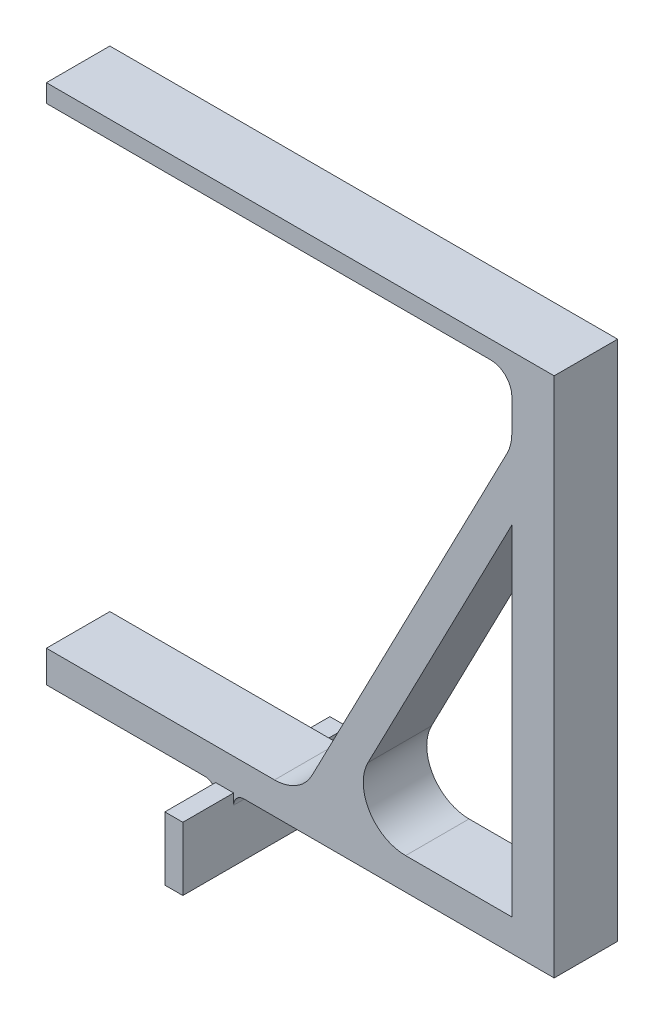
ISO-10303-21;
HEADER;
FILE_DESCRIPTION(('STEP AP214'),'2;1');
FILE_NAME('part.step','',(''),(''),'','','');
FILE_SCHEMA(('AUTOMOTIVE_DESIGN { 1 0 10303 214 1 1 1 1 }'));
ENDSEC;
DATA;
#1=APPLICATION_CONTEXT('core data for automotive mechanical design processes');
#2=APPLICATION_PROTOCOL_DEFINITION('international standard','automotive_design',2000,#1);
#3=PRODUCT_CONTEXT('',#1,'mechanical');
#4=PRODUCT('Part','Part','',(#3));
#5=PRODUCT_RELATED_PRODUCT_CATEGORY('part','',(#4));
#6=PRODUCT_DEFINITION_FORMATION('','',#4);
#7=PRODUCT_DEFINITION_CONTEXT('part definition',#1,'design');
#8=PRODUCT_DEFINITION('design','',#6,#7);
#9=PRODUCT_DEFINITION_SHAPE('','',#8);
#10=(LENGTH_UNIT() NAMED_UNIT(*) SI_UNIT(.MILLI.,.METRE.));
#11=(NAMED_UNIT(*) PLANE_ANGLE_UNIT() SI_UNIT($,.RADIAN.));
#12=(NAMED_UNIT(*) SI_UNIT($,.STERADIAN.) SOLID_ANGLE_UNIT());
#13=UNCERTAINTY_MEASURE_WITH_UNIT(LENGTH_MEASURE(1.E-05),#10,'distance_accuracy_value','');
#14=(GEOMETRIC_REPRESENTATION_CONTEXT(3) GLOBAL_UNCERTAINTY_ASSIGNED_CONTEXT((#13)) GLOBAL_UNIT_ASSIGNED_CONTEXT((#10,
#11,#12)) REPRESENTATION_CONTEXT('',''));
#15=CARTESIAN_POINT('',(0.,0.,0.));
#16=DIRECTION('',(0.,0.,1.));
#17=DIRECTION('',(1.,0.,0.));
#18=AXIS2_PLACEMENT_3D('',#15,#16,#17);
#19=CARTESIAN_POINT('',(0.,0.,3.));
#20=DIRECTION('',(0.,0.,1.));
#21=DIRECTION('',(1.,0.,0.));
#22=AXIS2_PLACEMENT_3D('',#19,#20,#21);
#23=PLANE('',#22);
#24=DIRECTION('',(-1.,0.,0.));
#25=VECTOR('',#24,1.);
#26=CARTESIAN_POINT('',(0.,3.,3.));
#27=LINE('',#26,#25);
#28=CARTESIAN_POINT('',(0.85,3.,3.));
#29=VERTEX_POINT('',#28);
#30=CARTESIAN_POINT('',(0.,3.,3.));
#31=VERTEX_POINT('',#30);
#32=EDGE_CURVE('E278',#29,#31,#27,.T.);
#33=ORIENTED_EDGE('',*,*,#32,.F.);
#34=DIRECTION('',(0.,1.,0.));
#35=VECTOR('',#34,1.);
#36=CARTESIAN_POINT('',(0.85,3.,3.));
#37=LINE('',#36,#35);
#38=CARTESIAN_POINT('',(0.85,2.5,3.));
#39=VERTEX_POINT('',#38);
#40=EDGE_CURVE('E403',#39,#29,#37,.T.);
#41=ORIENTED_EDGE('',*,*,#40,.F.);
#42=CARTESIAN_POINT('',(1.35,2.5,3.));
#43=DIRECTION('',(0.,0.,1.));
#44=DIRECTION('',(1.,0.,0.));
#45=AXIS2_PLACEMENT_3D('',#42,#43,#44);
#46=CIRCLE('',#45,0.5);
#47=CARTESIAN_POINT('',(1.35,3.,3.));
#48=VERTEX_POINT('',#47);
#49=EDGE_CURVE('E11',#39,#48,#46,.F.);
#50=ORIENTED_EDGE('',*,*,#49,.T.);
#51=DIRECTION('',(1.,0.,0.));
#52=VECTOR('',#51,1.);
#53=CARTESIAN_POINT('',(0.85,3.,3.));
#54=LINE('',#53,#52);
#55=CARTESIAN_POINT('',(16.,3.,3.));
#56=VERTEX_POINT('',#55);
#57=EDGE_CURVE('E224',#48,#56,#54,.T.);
#58=ORIENTED_EDGE('',*,*,#57,.T.);
#59=DIRECTION('',(0.,1.,0.));
#60=VECTOR('',#59,1.);
#61=CARTESIAN_POINT('',(16.,3.,3.));
#62=LINE('',#61,#60);
#63=CARTESIAN_POINT('',(16.,27.65,3.));
#64=VERTEX_POINT('',#63);
#65=EDGE_CURVE('E304',#56,#64,#62,.T.);
#66=ORIENTED_EDGE('',*,*,#65,.T.);
#67=DIRECTION('',(-1.,0.,0.));
#68=VECTOR('',#67,1.);
#69=CARTESIAN_POINT('',(14.,27.65,3.));
#70=LINE('',#69,#68);
#71=CARTESIAN_POINT('',(-8.,27.65,3.));
#72=VERTEX_POINT('',#71);
#73=EDGE_CURVE('E306',#64,#72,#70,.T.);
#74=ORIENTED_EDGE('',*,*,#73,.T.);
#75=DIRECTION('',(0.,-1.,0.));
#76=VECTOR('',#75,1.);
#77=CARTESIAN_POINT('',(-8.,27.65,3.));
#78=LINE('',#77,#76);
#79=CARTESIAN_POINT('',(-8.,26.8,3.));
#80=VERTEX_POINT('',#79);
#81=EDGE_CURVE('E308',#72,#80,#78,.T.);
#82=ORIENTED_EDGE('',*,*,#81,.T.);
#83=DIRECTION('',(1.,0.,0.));
#84=VECTOR('',#83,1.);
#85=CARTESIAN_POINT('',(14.,26.8,3.));
#86=LINE('',#85,#84);
#87=CARTESIAN_POINT('',(13.,26.8,3.));
#88=VERTEX_POINT('',#87);
#89=EDGE_CURVE('E310',#80,#88,#86,.T.);
#90=ORIENTED_EDGE('',*,*,#89,.T.);
#91=CARTESIAN_POINT('',(13.,25.8,3.));
#92=DIRECTION('',(0.,0.,1.));
#93=DIRECTION('',(1.,0.,0.));
#94=AXIS2_PLACEMENT_3D('',#91,#92,#93);
#95=CIRCLE('',#94,1.);
#96=CARTESIAN_POINT('',(14.,25.8,3.));
#97=VERTEX_POINT('',#96);
#98=EDGE_CURVE('E390',#88,#97,#95,.F.);
#99=ORIENTED_EDGE('',*,*,#98,.T.);
#100=DIRECTION('',(0.,-1.,0.));
#101=VECTOR('',#100,1.);
#102=CARTESIAN_POINT('',(14.,23.8,3.));
#103=LINE('',#102,#101);
#104=CARTESIAN_POINT('',(14.,24.2873670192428,3.));
#105=VERTEX_POINT('',#104);
#106=EDGE_CURVE('E313',#97,#105,#103,.T.);
#107=ORIENTED_EDGE('',*,*,#106,.T.);
#108=CARTESIAN_POINT('',(12.,24.2873670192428,3.));
#109=DIRECTION('',(0.,0.,1.));
#110=DIRECTION('',(1.,0.,0.));
#111=AXIS2_PLACEMENT_3D('',#108,#109,#110);
#112=CIRCLE('',#111,2.);
#113=CARTESIAN_POINT('',(13.7757874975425,23.367269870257,3.));
#114=VERTEX_POINT('',#113);
#115=EDGE_CURVE('E377',#105,#114,#112,.F.);
#116=ORIENTED_EDGE('',*,*,#115,.T.);
#117=DIRECTION('',(-0.460048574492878,-0.887893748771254,0.));
#118=VECTOR('',#117,1.);
#119=CARTESIAN_POINT('',(14.,23.8,3.));
#120=LINE('',#119,#118);
#121=CARTESIAN_POINT('',(4.55953515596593,5.57990285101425,3.));
#122=VERTEX_POINT('',#121);
#123=EDGE_CURVE('E315',#114,#122,#120,.T.);
#124=ORIENTED_EDGE('',*,*,#123,.T.);
#125=CARTESIAN_POINT('',(2.78374765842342,6.5,3.));
#126=DIRECTION('',(0.,0.,1.));
#127=DIRECTION('',(1.,0.,0.));
#128=AXIS2_PLACEMENT_3D('',#125,#126,#127);
#129=CIRCLE('',#128,2.);
#130=CARTESIAN_POINT('',(2.78374765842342,4.5,3.));
#131=VERTEX_POINT('',#130);
#132=EDGE_CURVE('E381',#122,#131,#129,.F.);
#133=ORIENTED_EDGE('',*,*,#132,.T.);
#134=DIRECTION('',(-1.,0.,0.));
#135=VECTOR('',#134,1.);
#136=CARTESIAN_POINT('',(-4.,4.5,3.));
#137=LINE('',#136,#135);
#138=CARTESIAN_POINT('',(-8.,4.5,3.));
#139=VERTEX_POINT('',#138);
#140=EDGE_CURVE('E318',#131,#139,#137,.T.);
#141=ORIENTED_EDGE('',*,*,#140,.T.);
#142=DIRECTION('',(0.,1.,0.));
#143=VECTOR('',#142,1.);
#144=CARTESIAN_POINT('',(-8.,3.,3.));
#145=LINE('',#144,#143);
#146=CARTESIAN_POINT('',(-8.,3.,3.));
#147=VERTEX_POINT('',#146);
#148=EDGE_CURVE('E235',#147,#139,#145,.T.);
#149=ORIENTED_EDGE('',*,*,#148,.F.);
#150=DIRECTION('',(1.,0.,0.));
#151=VECTOR('',#150,1.);
#152=CARTESIAN_POINT('',(0.,3.,3.));
#153=LINE('',#152,#151);
#154=CARTESIAN_POINT('',(-0.5,3.,3.));
#155=VERTEX_POINT('',#154);
#156=EDGE_CURVE('E231',#147,#155,#153,.T.);
#157=ORIENTED_EDGE('',*,*,#156,.T.);
#158=CARTESIAN_POINT('',(-0.5,2.5,3.));
#159=DIRECTION('',(0.,0.,1.));
#160=DIRECTION('',(1.,0.,0.));
#161=AXIS2_PLACEMENT_3D('',#158,#159,#160);
#162=CIRCLE('',#161,0.5);
#163=CARTESIAN_POINT('',(0.,2.5,3.));
#164=VERTEX_POINT('',#163);
#165=EDGE_CURVE('E410',#155,#164,#162,.F.);
#166=ORIENTED_EDGE('',*,*,#165,.T.);
#167=DIRECTION('',(0.,-1.,0.));
#168=VECTOR('',#167,1.);
#169=CARTESIAN_POINT('',(0.,3.,3.));
#170=LINE('',#169,#168);
#171=EDGE_CURVE('E62',#31,#164,#170,.T.);
#172=ORIENTED_EDGE('',*,*,#171,.F.);
#173=EDGE_LOOP('',(#33,#41,#50,#58,#66,#74,#82,#90,#99,#107,#116,#124,#133,#141,#149,#157,#166,#172));
#174=FACE_BOUND('',#173,.T.);
#175=DIRECTION('',(0.,1.,0.));
#176=VECTOR('',#175,1.);
#177=CARTESIAN_POINT('',(14.,4.5,3.));
#178=LINE('',#177,#176);
#179=CARTESIAN_POINT('',(14.,4.5,3.));
#180=VERTEX_POINT('',#179);
#181=CARTESIAN_POINT('',(14.,20.5394747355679,3.));
#182=VERTEX_POINT('',#181);
#183=EDGE_CURVE('E284',#180,#182,#178,.T.);
#184=ORIENTED_EDGE('',*,*,#183,.F.);
#185=DIRECTION('',(1.,0.,0.));
#186=VECTOR('',#185,1.);
#187=CARTESIAN_POINT('',(5.68939132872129,4.5,3.));
#188=LINE('',#187,#186);
#189=CARTESIAN_POINT('',(8.9781825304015,4.5,3.));
#190=VERTEX_POINT('',#189);
#191=EDGE_CURVE('E282',#190,#180,#188,.T.);
#192=ORIENTED_EDGE('',*,*,#191,.F.);
#193=CARTESIAN_POINT('',(8.9781825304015,6.5,3.));
#194=DIRECTION('',(0.,0.,1.));
#195=DIRECTION('',(1.,0.,0.));
#196=AXIS2_PLACEMENT_3D('',#193,#194,#195);
#197=CIRCLE('',#196,2.);
#198=CARTESIAN_POINT('',(7.20239503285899,7.42009714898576,3.));
#199=VERTEX_POINT('',#198);
#200=EDGE_CURVE('E372',#190,#199,#197,.F.);
#201=ORIENTED_EDGE('',*,*,#200,.T.);
#202=DIRECTION('',(-0.460048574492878,-0.887893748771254,0.));
#203=VECTOR('',#202,1.);
#204=CARTESIAN_POINT('',(5.68939132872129,4.5,3.));
#205=LINE('',#204,#203);
#206=EDGE_CURVE('E288',#182,#199,#205,.T.);
#207=ORIENTED_EDGE('',*,*,#206,.F.);
#208=EDGE_LOOP('',(#184,#192,#201,#207));
#209=FACE_BOUND('',#208,.T.);
#210=ADVANCED_FACE('F39',(#174,#209),#23,.T.);
#211=CARTESIAN_POINT('',(0.,0.,0.));
#212=DIRECTION('',(0.,0.,1.));
#213=DIRECTION('',(1.,0.,0.));
#214=AXIS2_PLACEMENT_3D('',#211,#212,#213);
#215=PLANE('',#214);
#216=DIRECTION('',(1.,0.,0.));
#217=VECTOR('',#216,1.);
#218=CARTESIAN_POINT('',(0.85,3.,0.));
#219=LINE('',#218,#217);
#220=CARTESIAN_POINT('',(1.35,3.,0.));
#221=VERTEX_POINT('',#220);
#222=CARTESIAN_POINT('',(16.,3.,0.));
#223=VERTEX_POINT('',#222);
#224=EDGE_CURVE('E302',#221,#223,#219,.T.);
#225=ORIENTED_EDGE('',*,*,#224,.F.);
#226=CARTESIAN_POINT('',(1.35,2.5,0.));
#227=DIRECTION('',(0.,0.,1.));
#228=DIRECTION('',(1.,0.,0.));
#229=AXIS2_PLACEMENT_3D('',#226,#227,#228);
#230=CIRCLE('',#229,0.5);
#231=CARTESIAN_POINT('',(0.85,2.5,0.));
#232=VERTEX_POINT('',#231);
#233=EDGE_CURVE('E47',#221,#232,#230,.T.);
#234=ORIENTED_EDGE('',*,*,#233,.T.);
#235=DIRECTION('',(0.,-1.,0.));
#236=VECTOR('',#235,1.);
#237=CARTESIAN_POINT('',(0.85,0.,0.));
#238=LINE('',#237,#236);
#239=CARTESIAN_POINT('',(0.85,3.,0.));
#240=VERTEX_POINT('',#239);
#241=EDGE_CURVE('E54',#240,#232,#238,.T.);
#242=ORIENTED_EDGE('',*,*,#241,.F.);
#243=DIRECTION('',(-1.,0.,0.));
#244=VECTOR('',#243,1.);
#245=CARTESIAN_POINT('',(0.,3.,0.));
#246=LINE('',#245,#244);
#247=CARTESIAN_POINT('',(0.,3.,0.));
#248=VERTEX_POINT('',#247);
#249=EDGE_CURVE('E273',#240,#248,#246,.T.);
#250=ORIENTED_EDGE('',*,*,#249,.T.);
#251=DIRECTION('',(0.,1.,0.));
#252=VECTOR('',#251,1.);
#253=CARTESIAN_POINT('',(0.,0.,0.));
#254=LINE('',#253,#252);
#255=CARTESIAN_POINT('',(0.,2.5,0.));
#256=VERTEX_POINT('',#255);
#257=EDGE_CURVE('E396',#256,#248,#254,.T.);
#258=ORIENTED_EDGE('',*,*,#257,.F.);
#259=CARTESIAN_POINT('',(-0.5,2.5,0.));
#260=DIRECTION('',(0.,0.,1.));
#261=DIRECTION('',(1.,0.,0.));
#262=AXIS2_PLACEMENT_3D('',#259,#260,#261);
#263=CIRCLE('',#262,0.5);
#264=CARTESIAN_POINT('',(-0.5,3.,0.));
#265=VERTEX_POINT('',#264);
#266=EDGE_CURVE('E221',#256,#265,#263,.T.);
#267=ORIENTED_EDGE('',*,*,#266,.T.);
#268=DIRECTION('',(1.,0.,0.));
#269=VECTOR('',#268,1.);
#270=CARTESIAN_POINT('',(0.,3.,0.));
#271=LINE('',#270,#269);
#272=CARTESIAN_POINT('',(-8.,3.,0.));
#273=VERTEX_POINT('',#272);
#274=EDGE_CURVE('E212',#273,#265,#271,.T.);
#275=ORIENTED_EDGE('',*,*,#274,.F.);
#276=DIRECTION('',(0.,-1.,0.));
#277=VECTOR('',#276,1.);
#278=CARTESIAN_POINT('',(-8.,3.,0.));
#279=LINE('',#278,#277);
#280=CARTESIAN_POINT('',(-8.,4.5,0.));
#281=VERTEX_POINT('',#280);
#282=EDGE_CURVE('E219',#281,#273,#279,.T.);
#283=ORIENTED_EDGE('',*,*,#282,.F.);
#284=DIRECTION('',(-1.,0.,0.));
#285=VECTOR('',#284,1.);
#286=CARTESIAN_POINT('',(-4.,4.5,0.));
#287=LINE('',#286,#285);
#288=CARTESIAN_POINT('',(2.78374765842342,4.5,0.));
#289=VERTEX_POINT('',#288);
#290=EDGE_CURVE('E225',#289,#281,#287,.T.);
#291=ORIENTED_EDGE('',*,*,#290,.F.);
#292=CARTESIAN_POINT('',(2.78374765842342,6.5,0.));
#293=DIRECTION('',(0.,0.,1.));
#294=DIRECTION('',(1.,0.,0.));
#295=AXIS2_PLACEMENT_3D('',#292,#293,#294);
#296=CIRCLE('',#295,2.);
#297=CARTESIAN_POINT('',(4.55953515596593,5.57990285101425,0.));
#298=VERTEX_POINT('',#297);
#299=EDGE_CURVE('E379',#289,#298,#296,.T.);
#300=ORIENTED_EDGE('',*,*,#299,.T.);
#301=DIRECTION('',(-0.460048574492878,-0.887893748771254,0.));
#302=VECTOR('',#301,1.);
#303=CARTESIAN_POINT('',(14.,23.8,0.));
#304=LINE('',#303,#302);
#305=CARTESIAN_POINT('',(13.7757874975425,23.367269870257,0.));
#306=VERTEX_POINT('',#305);
#307=EDGE_CURVE('E335',#306,#298,#304,.T.);
#308=ORIENTED_EDGE('',*,*,#307,.F.);
#309=CARTESIAN_POINT('',(12.,24.2873670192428,0.));
#310=DIRECTION('',(0.,0.,1.));
#311=DIRECTION('',(1.,0.,0.));
#312=AXIS2_PLACEMENT_3D('',#309,#310,#311);
#313=CIRCLE('',#312,2.);
#314=CARTESIAN_POINT('',(14.,24.2873670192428,0.));
#315=VERTEX_POINT('',#314);
#316=EDGE_CURVE('E374',#306,#315,#313,.T.);
#317=ORIENTED_EDGE('',*,*,#316,.T.);
#318=DIRECTION('',(0.,-1.,0.));
#319=VECTOR('',#318,1.);
#320=CARTESIAN_POINT('',(14.,23.8,0.));
#321=LINE('',#320,#319);
#322=CARTESIAN_POINT('',(14.,25.8,0.));
#323=VERTEX_POINT('',#322);
#324=EDGE_CURVE('E333',#323,#315,#321,.T.);
#325=ORIENTED_EDGE('',*,*,#324,.F.);
#326=CARTESIAN_POINT('',(13.,25.8,0.));
#327=DIRECTION('',(0.,0.,1.));
#328=DIRECTION('',(1.,0.,0.));
#329=AXIS2_PLACEMENT_3D('',#326,#327,#328);
#330=CIRCLE('',#329,1.);
#331=CARTESIAN_POINT('',(13.,26.8,0.));
#332=VERTEX_POINT('',#331);
#333=EDGE_CURVE('E388',#323,#332,#330,.T.);
#334=ORIENTED_EDGE('',*,*,#333,.T.);
#335=DIRECTION('',(1.,0.,0.));
#336=VECTOR('',#335,1.);
#337=CARTESIAN_POINT('',(14.,26.8,0.));
#338=LINE('',#337,#336);
#339=CARTESIAN_POINT('',(-8.,26.8,0.));
#340=VERTEX_POINT('',#339);
#341=EDGE_CURVE('E330',#340,#332,#338,.T.);
#342=ORIENTED_EDGE('',*,*,#341,.F.);
#343=DIRECTION('',(0.,-1.,0.));
#344=VECTOR('',#343,1.);
#345=CARTESIAN_POINT('',(-8.,27.65,0.));
#346=LINE('',#345,#344);
#347=CARTESIAN_POINT('',(-8.,27.65,0.));
#348=VERTEX_POINT('',#347);
#349=EDGE_CURVE('E328',#348,#340,#346,.T.);
#350=ORIENTED_EDGE('',*,*,#349,.F.);
#351=DIRECTION('',(-1.,0.,0.));
#352=VECTOR('',#351,1.);
#353=CARTESIAN_POINT('',(14.,27.65,0.));
#354=LINE('',#353,#352);
#355=CARTESIAN_POINT('',(16.,27.65,0.));
#356=VERTEX_POINT('',#355);
#357=EDGE_CURVE('E326',#356,#348,#354,.T.);
#358=ORIENTED_EDGE('',*,*,#357,.F.);
#359=DIRECTION('',(0.,1.,0.));
#360=VECTOR('',#359,1.);
#361=CARTESIAN_POINT('',(16.,3.,0.));
#362=LINE('',#361,#360);
#363=EDGE_CURVE('E323',#223,#356,#362,.T.);
#364=ORIENTED_EDGE('',*,*,#363,.F.);
#365=EDGE_LOOP('',(#225,#234,#242,#250,#258,#267,#275,#283,#291,#300,#308,#317,#325,#334,#342,
#350,#358,#364));
#366=FACE_BOUND('',#365,.T.);
#367=DIRECTION('',(-0.460048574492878,-0.887893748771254,0.));
#368=VECTOR('',#367,1.);
#369=CARTESIAN_POINT('',(5.68939132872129,4.5,0.));
#370=LINE('',#369,#368);
#371=CARTESIAN_POINT('',(14.,20.5394747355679,0.));
#372=VERTEX_POINT('',#371);
#373=CARTESIAN_POINT('',(7.20239503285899,7.42009714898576,0.));
#374=VERTEX_POINT('',#373);
#375=EDGE_CURVE('E285',#372,#374,#370,.T.);
#376=ORIENTED_EDGE('',*,*,#375,.T.);
#377=CARTESIAN_POINT('',(8.9781825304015,6.5,0.));
#378=DIRECTION('',(0.,0.,1.));
#379=DIRECTION('',(1.,0.,0.));
#380=AXIS2_PLACEMENT_3D('',#377,#378,#379);
#381=CIRCLE('',#380,2.);
#382=CARTESIAN_POINT('',(8.9781825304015,4.5,0.));
#383=VERTEX_POINT('',#382);
#384=EDGE_CURVE('E370',#374,#383,#381,.T.);
#385=ORIENTED_EDGE('',*,*,#384,.T.);
#386=DIRECTION('',(1.,0.,0.));
#387=VECTOR('',#386,1.);
#388=CARTESIAN_POINT('',(5.68939132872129,4.5,0.));
#389=LINE('',#388,#387);
#390=CARTESIAN_POINT('',(14.,4.5,0.));
#391=VERTEX_POINT('',#390);
#392=EDGE_CURVE('E281',#383,#391,#389,.T.);
#393=ORIENTED_EDGE('',*,*,#392,.T.);
#394=DIRECTION('',(0.,1.,0.));
#395=VECTOR('',#394,1.);
#396=CARTESIAN_POINT('',(14.,4.5,0.));
#397=LINE('',#396,#395);
#398=EDGE_CURVE('E293',#391,#372,#397,.T.);
#399=ORIENTED_EDGE('',*,*,#398,.T.);
#400=EDGE_LOOP('',(#376,#385,#393,#399));
#401=FACE_BOUND('',#400,.T.);
#402=ADVANCED_FACE('F215',(#366,#401),#215,.F.);
#403=CARTESIAN_POINT('',(0.85,3.,3.));
#404=DIRECTION('',(-1.,0.,0.));
#405=DIRECTION('',(0.,-1.,0.));
#406=AXIS2_PLACEMENT_3D('',#403,#404,#405);
#407=PLANE('',#406);
#408=DIRECTION('',(0.,0.,1.));
#409=VECTOR('',#408,1.);
#410=CARTESIAN_POINT('',(0.85,3.,-2.4));
#411=LINE('',#410,#409);
#412=CARTESIAN_POINT('',(0.85,3.,-2.4));
#413=VERTEX_POINT('',#412);
#414=EDGE_CURVE('E275',#413,#240,#411,.T.);
#415=ORIENTED_EDGE('',*,*,#414,.T.);
#416=ORIENTED_EDGE('',*,*,#241,.T.);
#417=DIRECTION('',(0.,0.,-1.));
#418=VECTOR('',#417,1.);
#419=CARTESIAN_POINT('',(0.85,2.5,3.));
#420=LINE('',#419,#418);
#421=EDGE_CURVE('E405',#232,#39,#420,.F.);
#422=ORIENTED_EDGE('',*,*,#421,.T.);
#423=ORIENTED_EDGE('',*,*,#40,.T.);
#424=CARTESIAN_POINT('',(0.85,3.,5.4));
#425=VERTEX_POINT('',#424);
#426=EDGE_CURVE('E269',#29,#425,#411,.T.);
#427=ORIENTED_EDGE('',*,*,#426,.T.);
#428=DIRECTION('',(0.,1.,0.));
#429=VECTOR('',#428,1.);
#430=CARTESIAN_POINT('',(0.85,0.,5.4));
#431=LINE('',#430,#429);
#432=CARTESIAN_POINT('',(0.85,0.,5.4));
#433=VERTEX_POINT('',#432);
#434=EDGE_CURVE('E251',#433,#425,#431,.T.);
#435=ORIENTED_EDGE('',*,*,#434,.F.);
#436=DIRECTION('',(0.,0.,-1.));
#437=VECTOR('',#436,1.);
#438=CARTESIAN_POINT('',(0.85,0.,3.));
#439=LINE('',#438,#437);
#440=CARTESIAN_POINT('',(0.85,0.,-2.4));
#441=VERTEX_POINT('',#440);
#442=EDGE_CURVE('E321',#433,#441,#439,.T.);
#443=ORIENTED_EDGE('',*,*,#442,.T.);
#444=DIRECTION('',(0.,1.,0.));
#445=VECTOR('',#444,1.);
#446=CARTESIAN_POINT('',(0.85,0.,-2.4));
#447=LINE('',#446,#445);
#448=EDGE_CURVE('E263',#441,#413,#447,.T.);
#449=ORIENTED_EDGE('',*,*,#448,.T.);
#450=EDGE_LOOP('',(#415,#416,#422,#423,#427,#435,#443,#449));
#451=FACE_BOUND('',#450,.T.);
#452=ADVANCED_FACE('F416',(#451),#407,.F.);
#453=CARTESIAN_POINT('',(0.85,3.,3.));
#454=DIRECTION('',(0.,1.,0.));
#455=DIRECTION('',(0.,0.,1.));
#456=AXIS2_PLACEMENT_3D('',#453,#454,#455);
#457=PLANE('',#456);
#458=ORIENTED_EDGE('',*,*,#57,.F.);
#459=DIRECTION('',(0.,0.,-1.));
#460=VECTOR('',#459,1.);
#461=CARTESIAN_POINT('',(1.35,3.,0.));
#462=LINE('',#461,#460);
#463=EDGE_CURVE('E400',#48,#221,#462,.T.);
#464=ORIENTED_EDGE('',*,*,#463,.T.);
#465=ORIENTED_EDGE('',*,*,#224,.T.);
#466=DIRECTION('',(0.,0.,-1.));
#467=VECTOR('',#466,1.);
#468=CARTESIAN_POINT('',(16.,3.,3.));
#469=LINE('',#468,#467);
#470=EDGE_CURVE('E351',#56,#223,#469,.T.);
#471=ORIENTED_EDGE('',*,*,#470,.F.);
#472=EDGE_LOOP('',(#458,#464,#465,#471));
#473=FACE_BOUND('',#472,.T.);
#474=ADVANCED_FACE('F423',(#473),#457,.F.);
#475=CARTESIAN_POINT('',(16.,3.,3.));
#476=DIRECTION('',(-1.,0.,0.));
#477=DIRECTION('',(0.,-1.,0.));
#478=AXIS2_PLACEMENT_3D('',#475,#476,#477);
#479=PLANE('',#478);
#480=ORIENTED_EDGE('',*,*,#363,.T.);
#481=DIRECTION('',(0.,0.,-1.));
#482=VECTOR('',#481,1.);
#483=CARTESIAN_POINT('',(16.,27.65,3.));
#484=LINE('',#483,#482);
#485=EDGE_CURVE('E348',#64,#356,#484,.T.);
#486=ORIENTED_EDGE('',*,*,#485,.F.);
#487=ORIENTED_EDGE('',*,*,#65,.F.);
#488=ORIENTED_EDGE('',*,*,#470,.T.);
#489=EDGE_LOOP('',(#480,#486,#487,#488));
#490=FACE_BOUND('',#489,.T.);
#491=ADVANCED_FACE('F427',(#490),#479,.F.);
#492=CARTESIAN_POINT('',(14.,27.65,3.));
#493=DIRECTION('',(0.,-1.,0.));
#494=DIRECTION('',(0.,0.,-1.));
#495=AXIS2_PLACEMENT_3D('',#492,#493,#494);
#496=PLANE('',#495);
#497=ORIENTED_EDGE('',*,*,#357,.T.);
#498=DIRECTION('',(0.,0.,-1.));
#499=VECTOR('',#498,1.);
#500=CARTESIAN_POINT('',(-8.,27.65,3.));
#501=LINE('',#500,#499);
#502=EDGE_CURVE('E345',#72,#348,#501,.T.);
#503=ORIENTED_EDGE('',*,*,#502,.F.);
#504=ORIENTED_EDGE('',*,*,#73,.F.);
#505=ORIENTED_EDGE('',*,*,#485,.T.);
#506=EDGE_LOOP('',(#497,#503,#504,#505));
#507=FACE_BOUND('',#506,.T.);
#508=ADVANCED_FACE('F433',(#507),#496,.F.);
#509=CARTESIAN_POINT('',(-8.,27.65,3.));
#510=DIRECTION('',(1.,0.,0.));
#511=DIRECTION('',(0.,0.,-1.));
#512=AXIS2_PLACEMENT_3D('',#509,#510,#511);
#513=PLANE('',#512);
#514=ORIENTED_EDGE('',*,*,#349,.T.);
#515=DIRECTION('',(0.,0.,-1.));
#516=VECTOR('',#515,1.);
#517=CARTESIAN_POINT('',(-8.,26.8,3.));
#518=LINE('',#517,#516);
#519=EDGE_CURVE('E342',#80,#340,#518,.T.);
#520=ORIENTED_EDGE('',*,*,#519,.F.);
#521=ORIENTED_EDGE('',*,*,#81,.F.);
#522=ORIENTED_EDGE('',*,*,#502,.T.);
#523=EDGE_LOOP('',(#514,#520,#521,#522));
#524=FACE_BOUND('',#523,.T.);
#525=ADVANCED_FACE('F436',(#524),#513,.F.);
#526=CARTESIAN_POINT('',(14.,26.8,3.));
#527=DIRECTION('',(0.,1.,0.));
#528=DIRECTION('',(-1.,0.,0.));
#529=AXIS2_PLACEMENT_3D('',#526,#527,#528);
#530=PLANE('',#529);
#531=ORIENTED_EDGE('',*,*,#341,.T.);
#532=DIRECTION('',(0.,0.,-1.));
#533=VECTOR('',#532,1.);
#534=CARTESIAN_POINT('',(13.,26.8,3.));
#535=LINE('',#534,#533);
#536=EDGE_CURVE('E386',#332,#88,#535,.F.);
#537=ORIENTED_EDGE('',*,*,#536,.T.);
#538=ORIENTED_EDGE('',*,*,#89,.F.);
#539=ORIENTED_EDGE('',*,*,#519,.T.);
#540=EDGE_LOOP('',(#531,#537,#538,#539));
#541=FACE_BOUND('',#540,.T.);
#542=ADVANCED_FACE('F440',(#541),#530,.F.);
#543=CARTESIAN_POINT('',(14.,23.8,3.));
#544=DIRECTION('',(1.,0.,0.));
#545=DIRECTION('',(0.,1.,0.));
#546=AXIS2_PLACEMENT_3D('',#543,#544,#545);
#547=PLANE('',#546);
#548=ORIENTED_EDGE('',*,*,#106,.F.);
#549=DIRECTION('',(0.,0.,-1.));
#550=VECTOR('',#549,1.);
#551=CARTESIAN_POINT('',(14.,25.8,0.));
#552=LINE('',#551,#550);
#553=EDGE_CURVE('E383',#97,#323,#552,.T.);
#554=ORIENTED_EDGE('',*,*,#553,.T.);
#555=ORIENTED_EDGE('',*,*,#324,.T.);
#556=DIRECTION('',(0.,0.,-1.));
#557=VECTOR('',#556,1.);
#558=CARTESIAN_POINT('',(14.,24.2873670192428,3.));
#559=LINE('',#558,#557);
#560=EDGE_CURVE('E364',#315,#105,#559,.F.);
#561=ORIENTED_EDGE('',*,*,#560,.T.);
#562=EDGE_LOOP('',(#548,#554,#555,#561));
#563=FACE_BOUND('',#562,.T.);
#564=ADVANCED_FACE('F449',(#563),#547,.F.);
#565=CARTESIAN_POINT('',(14.,23.8,3.));
#566=DIRECTION('',(0.887893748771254,-0.460048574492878,0.));
#567=DIRECTION('',(0.460048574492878,0.887893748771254,0.));
#568=AXIS2_PLACEMENT_3D('',#565,#566,#567);
#569=PLANE('',#568);
#570=ORIENTED_EDGE('',*,*,#123,.F.);
#571=DIRECTION('',(0.,0.,-1.));
#572=VECTOR('',#571,1.);
#573=CARTESIAN_POINT('',(13.7757874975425,23.367269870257,0.));
#574=LINE('',#573,#572);
#575=EDGE_CURVE('E361',#114,#306,#574,.T.);
#576=ORIENTED_EDGE('',*,*,#575,.T.);
#577=ORIENTED_EDGE('',*,*,#307,.T.);
#578=DIRECTION('',(0.,0.,-1.));
#579=VECTOR('',#578,1.);
#580=CARTESIAN_POINT('',(4.55953515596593,5.57990285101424,3.));
#581=LINE('',#580,#579);
#582=EDGE_CURVE('E359',#298,#122,#581,.F.);
#583=ORIENTED_EDGE('',*,*,#582,.T.);
#584=EDGE_LOOP('',(#570,#576,#577,#583));
#585=FACE_BOUND('',#584,.T.);
#586=ADVANCED_FACE('F459',(#585),#569,.F.);
#587=CARTESIAN_POINT('',(-4.,4.5,3.));
#588=DIRECTION('',(0.,-1.,0.));
#589=DIRECTION('',(0.,0.,-1.));
#590=AXIS2_PLACEMENT_3D('',#587,#588,#589);
#591=PLANE('',#590);
#592=ORIENTED_EDGE('',*,*,#140,.F.);
#593=DIRECTION('',(0.,0.,-1.));
#594=VECTOR('',#593,1.);
#595=CARTESIAN_POINT('',(2.78374765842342,4.5,0.));
#596=LINE('',#595,#594);
#597=EDGE_CURVE('E367',#131,#289,#596,.T.);
#598=ORIENTED_EDGE('',*,*,#597,.T.);
#599=ORIENTED_EDGE('',*,*,#290,.T.);
#600=DIRECTION('',(0.,0.,-1.));
#601=VECTOR('',#600,1.);
#602=CARTESIAN_POINT('',(-8.,4.5,0.));
#603=LINE('',#602,#601);
#604=EDGE_CURVE('E240',#139,#281,#603,.T.);
#605=ORIENTED_EDGE('',*,*,#604,.F.);
#606=EDGE_LOOP('',(#592,#598,#599,#605));
#607=FACE_BOUND('',#606,.T.);
#608=ADVANCED_FACE('F466',(#607),#591,.F.);
#609=CARTESIAN_POINT('',(0.,3.,3.));
#610=DIRECTION('',(0.,1.,0.));
#611=DIRECTION('',(-1.,0.,0.));
#612=AXIS2_PLACEMENT_3D('',#609,#610,#611);
#613=PLANE('',#612);
#614=ORIENTED_EDGE('',*,*,#274,.T.);
#615=DIRECTION('',(0.,0.,-1.));
#616=VECTOR('',#615,1.);
#617=CARTESIAN_POINT('',(-0.5,3.,3.));
#618=LINE('',#617,#616);
#619=EDGE_CURVE('E398',#265,#155,#618,.F.);
#620=ORIENTED_EDGE('',*,*,#619,.T.);
#621=ORIENTED_EDGE('',*,*,#156,.F.);
#622=DIRECTION('',(0.,0.,1.));
#623=VECTOR('',#622,1.);
#624=CARTESIAN_POINT('',(-8.,3.,0.));
#625=LINE('',#624,#623);
#626=EDGE_CURVE('E228',#273,#147,#625,.T.);
#627=ORIENTED_EDGE('',*,*,#626,.F.);
#628=EDGE_LOOP('',(#614,#620,#621,#627));
#629=FACE_BOUND('',#628,.T.);
#630=ADVANCED_FACE('F229',(#629),#613,.F.);
#631=CARTESIAN_POINT('',(0.,3.,3.));
#632=DIRECTION('',(1.,0.,0.));
#633=DIRECTION('',(0.,0.,-1.));
#634=AXIS2_PLACEMENT_3D('',#631,#632,#633);
#635=PLANE('',#634);
#636=DIRECTION('',(0.,0.,-1.));
#637=VECTOR('',#636,1.);
#638=CARTESIAN_POINT('',(0.,2.5,0.));
#639=LINE('',#638,#637);
#640=EDGE_CURVE('E393',#164,#256,#639,.T.);
#641=ORIENTED_EDGE('',*,*,#640,.T.);
#642=ORIENTED_EDGE('',*,*,#257,.T.);
#643=DIRECTION('',(0.,0.,1.));
#644=VECTOR('',#643,1.);
#645=CARTESIAN_POINT('',(0.,3.,-2.4));
#646=LINE('',#645,#644);
#647=CARTESIAN_POINT('',(0.,3.,-2.4));
#648=VERTEX_POINT('',#647);
#649=EDGE_CURVE('E270',#648,#248,#646,.T.);
#650=ORIENTED_EDGE('',*,*,#649,.F.);
#651=DIRECTION('',(0.,-1.,0.));
#652=VECTOR('',#651,1.);
#653=CARTESIAN_POINT('',(0.,0.,-2.4));
#654=LINE('',#653,#652);
#655=CARTESIAN_POINT('',(0.,0.,-2.4));
#656=VERTEX_POINT('',#655);
#657=EDGE_CURVE('E257',#648,#656,#654,.T.);
#658=ORIENTED_EDGE('',*,*,#657,.T.);
#659=DIRECTION('',(0.,0.,-1.));
#660=VECTOR('',#659,1.);
#661=CARTESIAN_POINT('',(0.,0.,3.));
#662=LINE('',#661,#660);
#663=CARTESIAN_POINT('',(0.,0.,5.4));
#664=VERTEX_POINT('',#663);
#665=EDGE_CURVE('E340',#664,#656,#662,.T.);
#666=ORIENTED_EDGE('',*,*,#665,.F.);
#667=DIRECTION('',(0.,-1.,0.));
#668=VECTOR('',#667,1.);
#669=CARTESIAN_POINT('',(0.,0.,5.4));
#670=LINE('',#669,#668);
#671=CARTESIAN_POINT('',(0.,3.,5.4));
#672=VERTEX_POINT('',#671);
#673=EDGE_CURVE('E245',#672,#664,#670,.T.);
#674=ORIENTED_EDGE('',*,*,#673,.F.);
#675=EDGE_CURVE('E274',#31,#672,#646,.T.);
#676=ORIENTED_EDGE('',*,*,#675,.F.);
#677=ORIENTED_EDGE('',*,*,#171,.T.);
#678=EDGE_LOOP('',(#641,#642,#650,#658,#666,#674,#676,#677));
#679=FACE_BOUND('',#678,.T.);
#680=ADVANCED_FACE('F473',(#679),#635,.F.);
#681=CARTESIAN_POINT('',(0.,0.,3.));
#682=DIRECTION('',(0.,1.,0.));
#683=DIRECTION('',(0.,0.,1.));
#684=AXIS2_PLACEMENT_3D('',#681,#682,#683);
#685=PLANE('',#684);
#686=ORIENTED_EDGE('',*,*,#665,.T.);
#687=DIRECTION('',(1.,0.,0.));
#688=VECTOR('',#687,1.);
#689=CARTESIAN_POINT('',(0.,0.,-2.4));
#690=LINE('',#689,#688);
#691=EDGE_CURVE('E260',#656,#441,#690,.T.);
#692=ORIENTED_EDGE('',*,*,#691,.T.);
#693=ORIENTED_EDGE('',*,*,#442,.F.);
#694=DIRECTION('',(1.,0.,0.));
#695=VECTOR('',#694,1.);
#696=CARTESIAN_POINT('',(0.,0.,5.4));
#697=LINE('',#696,#695);
#698=EDGE_CURVE('E248',#664,#433,#697,.T.);
#699=ORIENTED_EDGE('',*,*,#698,.F.);
#700=EDGE_LOOP('',(#686,#692,#693,#699));
#701=FACE_BOUND('',#700,.T.);
#702=ADVANCED_FACE('F486',(#701),#685,.F.);
#703=CARTESIAN_POINT('',(5.68939132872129,4.5,3.));
#704=DIRECTION('',(0.,1.,0.));
#705=DIRECTION('',(0.,0.,1.));
#706=AXIS2_PLACEMENT_3D('',#703,#704,#705);
#707=PLANE('',#706);
#708=ORIENTED_EDGE('',*,*,#392,.F.);
#709=DIRECTION('',(0.,0.,-1.));
#710=VECTOR('',#709,1.);
#711=CARTESIAN_POINT('',(8.9781825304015,4.5,3.));
#712=LINE('',#711,#710);
#713=EDGE_CURVE('E357',#383,#190,#712,.F.);
#714=ORIENTED_EDGE('',*,*,#713,.T.);
#715=ORIENTED_EDGE('',*,*,#191,.T.);
#716=DIRECTION('',(0.,0.,-1.));
#717=VECTOR('',#716,1.);
#718=CARTESIAN_POINT('',(14.,4.5,3.));
#719=LINE('',#718,#717);
#720=EDGE_CURVE('E299',#180,#391,#719,.T.);
#721=ORIENTED_EDGE('',*,*,#720,.T.);
#722=EDGE_LOOP('',(#708,#714,#715,#721));
#723=FACE_BOUND('',#722,.T.);
#724=ADVANCED_FACE('F483',(#723),#707,.T.);
#725=CARTESIAN_POINT('',(14.,4.5,3.));
#726=DIRECTION('',(-1.,0.,0.));
#727=DIRECTION('',(0.,-1.,0.));
#728=AXIS2_PLACEMENT_3D('',#725,#726,#727);
#729=PLANE('',#728);
#730=ORIENTED_EDGE('',*,*,#398,.F.);
#731=ORIENTED_EDGE('',*,*,#720,.F.);
#732=ORIENTED_EDGE('',*,*,#183,.T.);
#733=DIRECTION('',(0.,0.,-1.));
#734=VECTOR('',#733,1.);
#735=CARTESIAN_POINT('',(14.,20.5394747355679,3.));
#736=LINE('',#735,#734);
#737=EDGE_CURVE('E291',#182,#372,#736,.T.);
#738=ORIENTED_EDGE('',*,*,#737,.T.);
#739=EDGE_LOOP('',(#730,#731,#732,#738));
#740=FACE_BOUND('',#739,.T.);
#741=ADVANCED_FACE('F527',(#740),#729,.T.);
#742=CARTESIAN_POINT('',(5.68939132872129,4.5,3.));
#743=DIRECTION('',(0.887893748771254,-0.460048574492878,0.));
#744=DIRECTION('',(0.460048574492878,0.887893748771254,0.));
#745=AXIS2_PLACEMENT_3D('',#742,#743,#744);
#746=PLANE('',#745);
#747=ORIENTED_EDGE('',*,*,#206,.T.);
#748=DIRECTION('',(0.,0.,-1.));
#749=VECTOR('',#748,1.);
#750=CARTESIAN_POINT('',(7.20239503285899,7.42009714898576,0.));
#751=LINE('',#750,#749);
#752=EDGE_CURVE('E354',#199,#374,#751,.T.);
#753=ORIENTED_EDGE('',*,*,#752,.T.);
#754=ORIENTED_EDGE('',*,*,#375,.F.);
#755=ORIENTED_EDGE('',*,*,#737,.F.);
#756=EDGE_LOOP('',(#747,#753,#754,#755));
#757=FACE_BOUND('',#756,.T.);
#758=ADVANCED_FACE('F524',(#757),#746,.T.);
#759=CARTESIAN_POINT('',(8.9781825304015,6.5,3.));
#760=DIRECTION('',(0.,0.,1.));
#761=DIRECTION('',(1.,0.,0.));
#762=AXIS2_PLACEMENT_3D('',#759,#760,#761);
#763=CYLINDRICAL_SURFACE('',#762,2.);
#764=ORIENTED_EDGE('',*,*,#200,.F.);
#765=ORIENTED_EDGE('',*,*,#713,.F.);
#766=ORIENTED_EDGE('',*,*,#384,.F.);
#767=ORIENTED_EDGE('',*,*,#752,.F.);
#768=EDGE_LOOP('',(#764,#765,#766,#767));
#769=FACE_BOUND('',#768,.T.);
#770=ADVANCED_FACE('F526',(#769),#763,.F.);
#771=CARTESIAN_POINT('',(12.,24.2873670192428,3.));
#772=DIRECTION('',(0.,0.,1.));
#773=DIRECTION('',(1.,0.,0.));
#774=AXIS2_PLACEMENT_3D('',#771,#772,#773);
#775=CYLINDRICAL_SURFACE('',#774,2.);
#776=ORIENTED_EDGE('',*,*,#115,.F.);
#777=ORIENTED_EDGE('',*,*,#560,.F.);
#778=ORIENTED_EDGE('',*,*,#316,.F.);
#779=ORIENTED_EDGE('',*,*,#575,.F.);
#780=EDGE_LOOP('',(#776,#777,#778,#779));
#781=FACE_BOUND('',#780,.T.);
#782=ADVANCED_FACE('F455',(#781),#775,.F.);
#783=CARTESIAN_POINT('',(2.78374765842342,6.5,3.));
#784=DIRECTION('',(0.,0.,1.));
#785=DIRECTION('',(1.,0.,0.));
#786=AXIS2_PLACEMENT_3D('',#783,#784,#785);
#787=CYLINDRICAL_SURFACE('',#786,2.);
#788=ORIENTED_EDGE('',*,*,#132,.F.);
#789=ORIENTED_EDGE('',*,*,#582,.F.);
#790=ORIENTED_EDGE('',*,*,#299,.F.);
#791=ORIENTED_EDGE('',*,*,#597,.F.);
#792=EDGE_LOOP('',(#788,#789,#790,#791));
#793=FACE_BOUND('',#792,.T.);
#794=ADVANCED_FACE('F462',(#793),#787,.F.);
#795=CARTESIAN_POINT('',(13.,25.8,3.));
#796=DIRECTION('',(0.,0.,1.));
#797=DIRECTION('',(1.,0.,0.));
#798=AXIS2_PLACEMENT_3D('',#795,#796,#797);
#799=CYLINDRICAL_SURFACE('',#798,1.);
#800=ORIENTED_EDGE('',*,*,#98,.F.);
#801=ORIENTED_EDGE('',*,*,#536,.F.);
#802=ORIENTED_EDGE('',*,*,#333,.F.);
#803=ORIENTED_EDGE('',*,*,#553,.F.);
#804=EDGE_LOOP('',(#800,#801,#802,#803));
#805=FACE_BOUND('',#804,.T.);
#806=ADVANCED_FACE('F446',(#805),#799,.F.);
#807=CARTESIAN_POINT('',(0.,0.,-2.4));
#808=DIRECTION('',(0.,0.,-1.));
#809=DIRECTION('',(-1.,0.,0.));
#810=AXIS2_PLACEMENT_3D('',#807,#808,#809);
#811=PLANE('',#810);
#812=ORIENTED_EDGE('',*,*,#657,.F.);
#813=DIRECTION('',(-1.,0.,0.));
#814=VECTOR('',#813,1.);
#815=CARTESIAN_POINT('',(0.,3.,-2.4));
#816=LINE('',#815,#814);
#817=EDGE_CURVE('E266',#413,#648,#816,.T.);
#818=ORIENTED_EDGE('',*,*,#817,.F.);
#819=ORIENTED_EDGE('',*,*,#448,.F.);
#820=ORIENTED_EDGE('',*,*,#691,.F.);
#821=EDGE_LOOP('',(#812,#818,#819,#820));
#822=FACE_BOUND('',#821,.T.);
#823=ADVANCED_FACE('F504',(#822),#811,.T.);
#824=CARTESIAN_POINT('',(0.,3.,-2.4));
#825=DIRECTION('',(0.,1.,0.));
#826=DIRECTION('',(0.,0.,1.));
#827=AXIS2_PLACEMENT_3D('',#824,#825,#826);
#828=PLANE('',#827);
#829=ORIENTED_EDGE('',*,*,#249,.F.);
#830=ORIENTED_EDGE('',*,*,#414,.F.);
#831=ORIENTED_EDGE('',*,*,#817,.T.);
#832=ORIENTED_EDGE('',*,*,#649,.T.);
#833=EDGE_LOOP('',(#829,#830,#831,#832));
#834=FACE_BOUND('',#833,.T.);
#835=ADVANCED_FACE('F499',(#834),#828,.T.);
#836=ORIENTED_EDGE('',*,*,#426,.F.);
#837=ORIENTED_EDGE('',*,*,#32,.T.);
#838=ORIENTED_EDGE('',*,*,#675,.T.);
#839=DIRECTION('',(-1.,0.,0.));
#840=VECTOR('',#839,1.);
#841=CARTESIAN_POINT('',(0.,3.,5.4));
#842=LINE('',#841,#840);
#843=EDGE_CURVE('E254',#425,#672,#842,.T.);
#844=ORIENTED_EDGE('',*,*,#843,.F.);
#845=EDGE_LOOP('',(#836,#837,#838,#844));
#846=FACE_BOUND('',#845,.T.);
#847=ADVANCED_FACE('F514',(#846),#828,.T.);
#848=CARTESIAN_POINT('',(0.,0.,5.4));
#849=DIRECTION('',(0.,0.,-1.));
#850=DIRECTION('',(-1.,0.,0.));
#851=AXIS2_PLACEMENT_3D('',#848,#849,#850);
#852=PLANE('',#851);
#853=ORIENTED_EDGE('',*,*,#673,.T.);
#854=ORIENTED_EDGE('',*,*,#698,.T.);
#855=ORIENTED_EDGE('',*,*,#434,.T.);
#856=ORIENTED_EDGE('',*,*,#843,.T.);
#857=EDGE_LOOP('',(#853,#854,#855,#856));
#858=FACE_BOUND('',#857,.T.);
#859=ADVANCED_FACE('F509',(#858),#852,.F.);
#860=CARTESIAN_POINT('',(-0.5,2.5,3.));
#861=DIRECTION('',(0.,0.,1.));
#862=DIRECTION('',(1.,0.,0.));
#863=AXIS2_PLACEMENT_3D('',#860,#861,#862);
#864=CYLINDRICAL_SURFACE('',#863,0.5);
#865=ORIENTED_EDGE('',*,*,#165,.F.);
#866=ORIENTED_EDGE('',*,*,#619,.F.);
#867=ORIENTED_EDGE('',*,*,#266,.F.);
#868=ORIENTED_EDGE('',*,*,#640,.F.);
#869=EDGE_LOOP('',(#865,#866,#867,#868));
#870=FACE_BOUND('',#869,.T.);
#871=ADVANCED_FACE('F497',(#870),#864,.F.);
#872=CARTESIAN_POINT('',(1.35,2.5,3.));
#873=DIRECTION('',(0.,0.,1.));
#874=DIRECTION('',(1.,0.,0.));
#875=AXIS2_PLACEMENT_3D('',#872,#873,#874);
#876=CYLINDRICAL_SURFACE('',#875,0.5);
#877=ORIENTED_EDGE('',*,*,#49,.F.);
#878=ORIENTED_EDGE('',*,*,#421,.F.);
#879=ORIENTED_EDGE('',*,*,#233,.F.);
#880=ORIENTED_EDGE('',*,*,#463,.F.);
#881=EDGE_LOOP('',(#877,#878,#879,#880));
#882=FACE_BOUND('',#881,.T.);
#883=ADVANCED_FACE('F41',(#882),#876,.F.);
#884=CARTESIAN_POINT('',(-8.,0.,0.));
#885=DIRECTION('',(1.,0.,0.));
#886=DIRECTION('',(0.,1.,0.));
#887=AXIS2_PLACEMENT_3D('',#884,#885,#886);
#888=PLANE('',#887);
#889=ORIENTED_EDGE('',*,*,#282,.T.);
#890=ORIENTED_EDGE('',*,*,#626,.T.);
#891=ORIENTED_EDGE('',*,*,#148,.T.);
#892=ORIENTED_EDGE('',*,*,#604,.T.);
#893=EDGE_LOOP('',(#889,#890,#891,#892));
#894=FACE_BOUND('',#893,.T.);
#895=ADVANCED_FACE('F238',(#894),#888,.F.);
#896=CLOSED_SHELL('',(#210,#402,#452,#474,#491,#508,#525,#542,#564,#586,#608,#630,#680,#702,
#724,#741,#758,#770,#782,#794,#806,#823,#835,#847,#859,#871,#883,#895));
#897=MANIFOLD_SOLID_BREP('B2',#896);
#898=ADVANCED_BREP_SHAPE_REPRESENTATION('',(#18,#897),#14);
#899=SHAPE_DEFINITION_REPRESENTATION(#9,#898);
ENDSEC;
END-ISO-10303-21;
